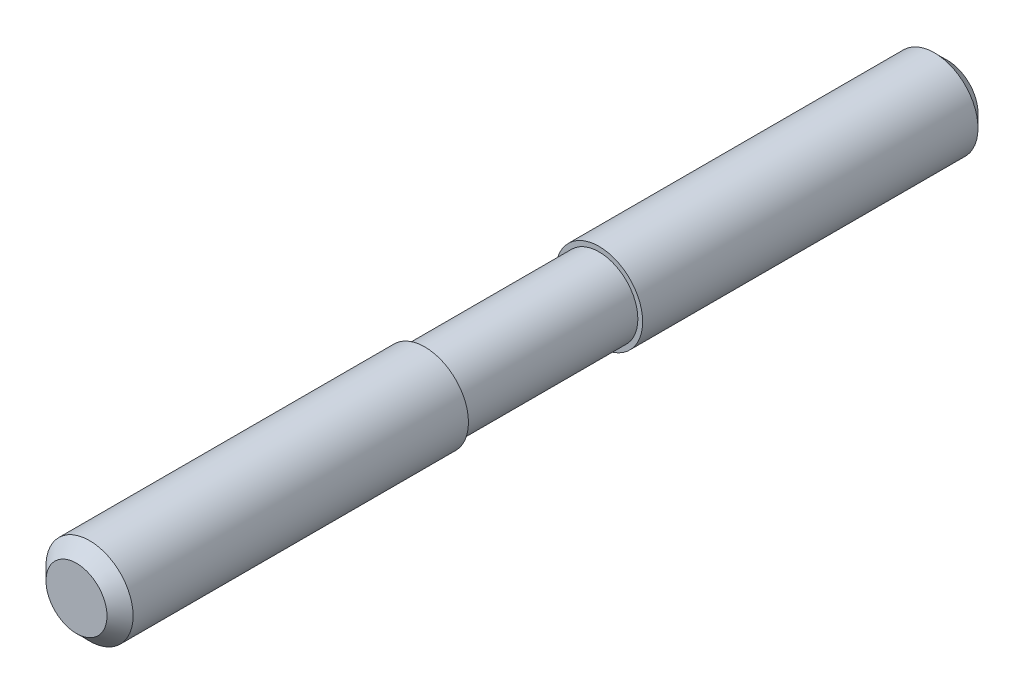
ISO-10303-21;
HEADER;
FILE_DESCRIPTION(('STEP AP214'),'2;1');
FILE_NAME('part.step','',(''),(''),'','','');
FILE_SCHEMA(('AUTOMOTIVE_DESIGN { 1 0 10303 214 1 1 1 1 }'));
ENDSEC;
DATA;
#1=APPLICATION_CONTEXT('core data for automotive mechanical design processes');
#2=APPLICATION_PROTOCOL_DEFINITION('international standard','automotive_design',2000,#1);
#3=PRODUCT_CONTEXT('',#1,'mechanical');
#4=PRODUCT('Part','Part','',(#3));
#5=PRODUCT_RELATED_PRODUCT_CATEGORY('part','',(#4));
#6=PRODUCT_DEFINITION_FORMATION('','',#4);
#7=PRODUCT_DEFINITION_CONTEXT('part definition',#1,'design');
#8=PRODUCT_DEFINITION('design','',#6,#7);
#9=PRODUCT_DEFINITION_SHAPE('','',#8);
#10=(LENGTH_UNIT() NAMED_UNIT(*) SI_UNIT(.MILLI.,.METRE.));
#11=(NAMED_UNIT(*) PLANE_ANGLE_UNIT() SI_UNIT($,.RADIAN.));
#12=(NAMED_UNIT(*) SI_UNIT($,.STERADIAN.) SOLID_ANGLE_UNIT());
#13=UNCERTAINTY_MEASURE_WITH_UNIT(LENGTH_MEASURE(1.E-05),#10,'distance_accuracy_value','');
#14=(GEOMETRIC_REPRESENTATION_CONTEXT(3) GLOBAL_UNCERTAINTY_ASSIGNED_CONTEXT((#13)) GLOBAL_UNIT_ASSIGNED_CONTEXT((#10,
#11,#12)) REPRESENTATION_CONTEXT('',''));
#15=CARTESIAN_POINT('',(0.,0.,0.));
#16=DIRECTION('',(0.,0.,1.));
#17=DIRECTION('',(1.,0.,0.));
#18=AXIS2_PLACEMENT_3D('',#15,#16,#17);
#19=CARTESIAN_POINT('',(0.,0.,0.));
#20=DIRECTION('',(0.,0.,1.));
#21=DIRECTION('',(1.,0.,0.));
#22=AXIS2_PLACEMENT_3D('',#19,#20,#21);
#23=PLANE('',#22);
#24=CARTESIAN_POINT('',(0.,0.,0.));
#25=DIRECTION('',(0.,0.,1.));
#26=DIRECTION('',(1.,0.,0.));
#27=AXIS2_PLACEMENT_3D('',#24,#25,#26);
#28=CIRCLE('',#27,3.5);
#29=CARTESIAN_POINT('',(3.5,0.,0.));
#30=VERTEX_POINT('',#29);
#31=EDGE_CURVE('E8',#30,#30,#28,.T.);
#32=ORIENTED_EDGE('',*,*,#31,.F.);
#33=EDGE_LOOP('',(#32));
#34=FACE_BOUND('',#33,.T.);
#35=ADVANCED_FACE('F12',(#34),#23,.F.);
#36=CARTESIAN_POINT('',(0.,0.,1.5));
#37=DIRECTION('',(0.,0.,1.));
#38=DIRECTION('',(1.,0.,0.));
#39=AXIS2_PLACEMENT_3D('',#36,#37,#38);
#40=CONICAL_SURFACE('',#39,5.,0.785398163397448);
#41=ORIENTED_EDGE('',*,*,#31,.T.);
#42=EDGE_LOOP('',(#41));
#43=FACE_BOUND('',#42,.T.);
#44=CARTESIAN_POINT('',(0.,0.,1.5));
#45=DIRECTION('',(0.,0.,1.));
#46=DIRECTION('',(1.,0.,0.));
#47=AXIS2_PLACEMENT_3D('',#44,#45,#46);
#48=CIRCLE('',#47,5.);
#49=CARTESIAN_POINT('',(5.,0.,1.5));
#50=VERTEX_POINT('',#49);
#51=EDGE_CURVE('E18',#50,#50,#48,.T.);
#52=ORIENTED_EDGE('',*,*,#51,.F.);
#53=EDGE_LOOP('',(#52));
#54=FACE_BOUND('',#53,.T.);
#55=ADVANCED_FACE('F62',(#43,#54),#40,.T.);
#56=CARTESIAN_POINT('',(0.,0.,70.));
#57=DIRECTION('',(0.,0.,1.));
#58=DIRECTION('',(1.,0.,0.));
#59=AXIS2_PLACEMENT_3D('',#56,#57,#58);
#60=CYLINDRICAL_SURFACE('',#59,5.);
#61=CARTESIAN_POINT('',(0.,0.,40.));
#62=DIRECTION('',(0.,0.,1.));
#63=DIRECTION('',(1.,0.,0.));
#64=AXIS2_PLACEMENT_3D('',#61,#62,#63);
#65=CIRCLE('',#64,5.);
#66=CARTESIAN_POINT('',(5.,0.,40.));
#67=VERTEX_POINT('',#66);
#68=EDGE_CURVE('E22',#67,#67,#65,.T.);
#69=ORIENTED_EDGE('',*,*,#68,.F.);
#70=EDGE_LOOP('',(#69));
#71=FACE_BOUND('',#70,.T.);
#72=ORIENTED_EDGE('',*,*,#51,.T.);
#73=EDGE_LOOP('',(#72));
#74=FACE_BOUND('',#73,.T.);
#75=ADVANCED_FACE('F68',(#71,#74),#60,.T.);
#76=CARTESIAN_POINT('',(5.,0.,40.));
#77=DIRECTION('',(0.,0.,-1.));
#78=DIRECTION('',(-1.,0.,0.));
#79=AXIS2_PLACEMENT_3D('',#76,#77,#78);
#80=PLANE('',#79);
#81=CARTESIAN_POINT('',(0.,0.,40.));
#82=DIRECTION('',(0.,0.,1.));
#83=DIRECTION('',(1.,0.,0.));
#84=AXIS2_PLACEMENT_3D('',#81,#82,#83);
#85=CIRCLE('',#84,4.45);
#86=CARTESIAN_POINT('',(4.45,0.,40.));
#87=VERTEX_POINT('',#86);
#88=EDGE_CURVE('E26',#87,#87,#85,.T.);
#89=ORIENTED_EDGE('',*,*,#88,.F.);
#90=EDGE_LOOP('',(#89));
#91=FACE_BOUND('',#90,.T.);
#92=ORIENTED_EDGE('',*,*,#68,.T.);
#93=EDGE_LOOP('',(#92));
#94=FACE_BOUND('',#93,.T.);
#95=ADVANCED_FACE('F73',(#91,#94),#80,.F.);
#96=CARTESIAN_POINT('',(0.,0.,70.));
#97=DIRECTION('',(0.,0.,1.));
#98=DIRECTION('',(1.,0.,0.));
#99=AXIS2_PLACEMENT_3D('',#96,#97,#98);
#100=CYLINDRICAL_SURFACE('',#99,4.45);
#101=CARTESIAN_POINT('',(0.,0.,60.));
#102=DIRECTION('',(0.,0.,1.));
#103=DIRECTION('',(1.,0.,0.));
#104=AXIS2_PLACEMENT_3D('',#101,#102,#103);
#105=CIRCLE('',#104,4.45);
#106=CARTESIAN_POINT('',(4.45,0.,60.));
#107=VERTEX_POINT('',#106);
#108=EDGE_CURVE('E31',#107,#107,#105,.T.);
#109=ORIENTED_EDGE('',*,*,#108,.F.);
#110=EDGE_LOOP('',(#109));
#111=FACE_BOUND('',#110,.T.);
#112=ORIENTED_EDGE('',*,*,#88,.T.);
#113=EDGE_LOOP('',(#112));
#114=FACE_BOUND('',#113,.T.);
#115=ADVANCED_FACE('F80',(#111,#114),#100,.T.);
#116=CARTESIAN_POINT('',(4.45,0.,60.));
#117=DIRECTION('',(0.,0.,1.));
#118=DIRECTION('',(1.,0.,0.));
#119=AXIS2_PLACEMENT_3D('',#116,#117,#118);
#120=PLANE('',#119);
#121=CARTESIAN_POINT('',(0.,0.,60.));
#122=DIRECTION('',(0.,0.,1.));
#123=DIRECTION('',(1.,0.,0.));
#124=AXIS2_PLACEMENT_3D('',#121,#122,#123);
#125=CIRCLE('',#124,5.);
#126=CARTESIAN_POINT('',(5.,0.,60.));
#127=VERTEX_POINT('',#126);
#128=EDGE_CURVE('E34',#127,#127,#125,.T.);
#129=ORIENTED_EDGE('',*,*,#128,.F.);
#130=EDGE_LOOP('',(#129));
#131=FACE_BOUND('',#130,.T.);
#132=ORIENTED_EDGE('',*,*,#108,.T.);
#133=EDGE_LOOP('',(#132));
#134=FACE_BOUND('',#133,.T.);
#135=ADVANCED_FACE('F58',(#131,#134),#120,.F.);
#136=CARTESIAN_POINT('',(0.,0.,70.));
#137=DIRECTION('',(0.,0.,1.));
#138=DIRECTION('',(1.,0.,0.));
#139=AXIS2_PLACEMENT_3D('',#136,#137,#138);
#140=CYLINDRICAL_SURFACE('',#139,5.);
#141=CARTESIAN_POINT('',(0.,0.,98.5));
#142=DIRECTION('',(0.,0.,1.));
#143=DIRECTION('',(1.,0.,0.));
#144=AXIS2_PLACEMENT_3D('',#141,#142,#143);
#145=CIRCLE('',#144,5.);
#146=CARTESIAN_POINT('',(5.,0.,98.5));
#147=VERTEX_POINT('',#146);
#148=EDGE_CURVE('E37',#147,#147,#145,.T.);
#149=ORIENTED_EDGE('',*,*,#148,.F.);
#150=EDGE_LOOP('',(#149));
#151=FACE_BOUND('',#150,.T.);
#152=ORIENTED_EDGE('',*,*,#128,.T.);
#153=EDGE_LOOP('',(#152));
#154=FACE_BOUND('',#153,.T.);
#155=ADVANCED_FACE('F48',(#151,#154),#140,.T.);
#156=CARTESIAN_POINT('',(0.,0.,100.));
#157=DIRECTION('',(0.,0.,-1.));
#158=DIRECTION('',(-1.,0.,0.));
#159=AXIS2_PLACEMENT_3D('',#156,#157,#158);
#160=CONICAL_SURFACE('',#159,3.5,0.785398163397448);
#161=ORIENTED_EDGE('',*,*,#148,.T.);
#162=EDGE_LOOP('',(#161));
#163=FACE_BOUND('',#162,.T.);
#164=CARTESIAN_POINT('',(0.,0.,100.));
#165=DIRECTION('',(0.,0.,1.));
#166=DIRECTION('',(1.,0.,0.));
#167=AXIS2_PLACEMENT_3D('',#164,#165,#166);
#168=CIRCLE('',#167,3.5);
#169=CARTESIAN_POINT('',(3.5,0.,100.));
#170=VERTEX_POINT('',#169);
#171=EDGE_CURVE('E40',#170,#170,#168,.T.);
#172=ORIENTED_EDGE('',*,*,#171,.F.);
#173=EDGE_LOOP('',(#172));
#174=FACE_BOUND('',#173,.T.);
#175=ADVANCED_FACE('F46',(#163,#174),#160,.T.);
#176=CARTESIAN_POINT('',(3.5,0.,100.));
#177=DIRECTION('',(0.,0.,-1.));
#178=DIRECTION('',(-1.,0.,0.));
#179=AXIS2_PLACEMENT_3D('',#176,#177,#178);
#180=PLANE('',#179);
#181=ORIENTED_EDGE('',*,*,#171,.T.);
#182=EDGE_LOOP('',(#181));
#183=FACE_BOUND('',#182,.T.);
#184=ADVANCED_FACE('F44',(#183),#180,.F.);
#185=CLOSED_SHELL('',(#35,#55,#75,#95,#115,#135,#155,#175,#184));
#186=MANIFOLD_SOLID_BREP('B1',#185);
#187=ADVANCED_BREP_SHAPE_REPRESENTATION('',(#18,#186),#14);
#188=SHAPE_DEFINITION_REPRESENTATION(#9,#187);
ENDSEC;
END-ISO-10303-21;
